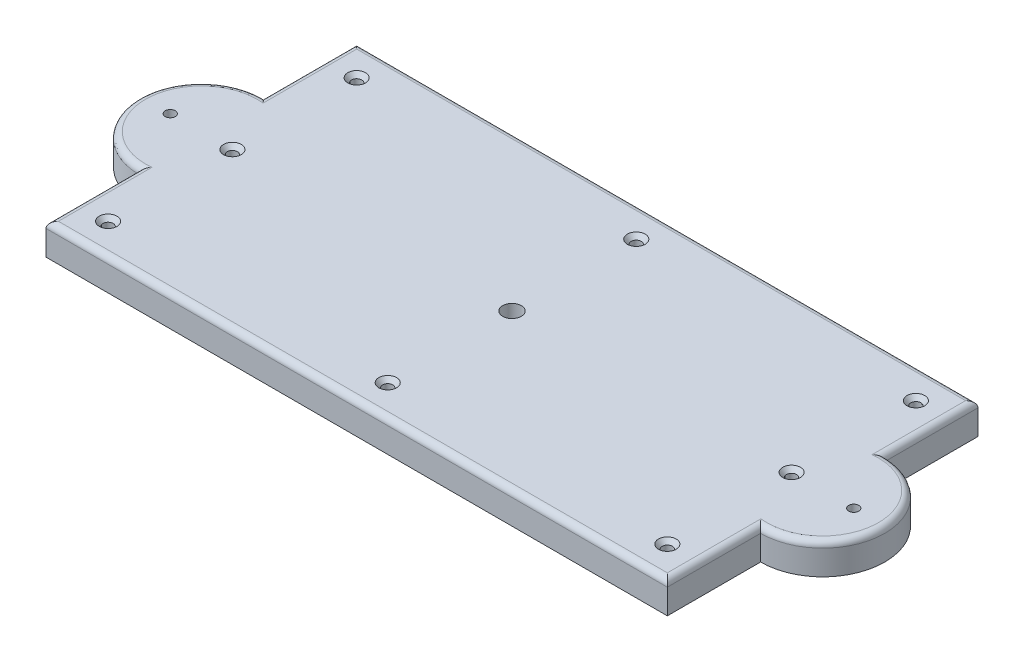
ISO-10303-21;
HEADER;
FILE_DESCRIPTION(('STEP AP214'),'2;1');
FILE_NAME('part.step','',(''),(''),'','','');
FILE_SCHEMA(('AUTOMOTIVE_DESIGN { 1 0 10303 214 1 1 1 1 }'));
ENDSEC;
DATA;
#1=APPLICATION_CONTEXT('core data for automotive mechanical design processes');
#2=APPLICATION_PROTOCOL_DEFINITION('international standard','automotive_design',2000,#1);
#3=PRODUCT_CONTEXT('',#1,'mechanical');
#4=PRODUCT('Part','Part','',(#3));
#5=PRODUCT_RELATED_PRODUCT_CATEGORY('part','',(#4));
#6=PRODUCT_DEFINITION_FORMATION('','',#4);
#7=PRODUCT_DEFINITION_CONTEXT('part definition',#1,'design');
#8=PRODUCT_DEFINITION('design','',#6,#7);
#9=PRODUCT_DEFINITION_SHAPE('','',#8);
#10=(LENGTH_UNIT() NAMED_UNIT(*) SI_UNIT(.MILLI.,.METRE.));
#11=(NAMED_UNIT(*) PLANE_ANGLE_UNIT() SI_UNIT($,.RADIAN.));
#12=(NAMED_UNIT(*) SI_UNIT($,.STERADIAN.) SOLID_ANGLE_UNIT());
#13=UNCERTAINTY_MEASURE_WITH_UNIT(LENGTH_MEASURE(1.E-05),#10,'distance_accuracy_value','');
#14=(GEOMETRIC_REPRESENTATION_CONTEXT(3) GLOBAL_UNCERTAINTY_ASSIGNED_CONTEXT((#13)) GLOBAL_UNIT_ASSIGNED_CONTEXT((#10,
#11,#12)) REPRESENTATION_CONTEXT('',''));
#15=CARTESIAN_POINT('',(0.,0.,0.));
#16=DIRECTION('',(0.,0.,1.));
#17=DIRECTION('',(1.,0.,0.));
#18=AXIS2_PLACEMENT_3D('',#15,#16,#17);
#19=CARTESIAN_POINT('',(0.,10.,-30.));
#20=DIRECTION('',(1.,0.,0.));
#21=DIRECTION('',(0.,0.,-1.));
#22=AXIS2_PLACEMENT_3D('',#19,#20,#21);
#23=PLANE('',#22);
#24=DIRECTION('',(0.,-1.,0.));
#25=VECTOR('',#24,1.);
#26=CARTESIAN_POINT('',(0.,10.,0.));
#27=LINE('',#26,#25);
#28=CARTESIAN_POINT('',(0.,8.,0.));
#29=VERTEX_POINT('',#28);
#30=CARTESIAN_POINT('',(0.,0.,0.));
#31=VERTEX_POINT('',#30);
#32=EDGE_CURVE('E135',#29,#31,#27,.T.);
#33=ORIENTED_EDGE('',*,*,#32,.F.);
#34=DIRECTION('',(0.,0.,1.));
#35=VECTOR('',#34,1.);
#36=CARTESIAN_POINT('',(0.,8.,-30.));
#37=LINE('',#36,#35);
#38=CARTESIAN_POINT('',(0.,8.,-30.));
#39=VERTEX_POINT('',#38);
#40=EDGE_CURVE('E55',#29,#39,#37,.F.);
#41=ORIENTED_EDGE('',*,*,#40,.T.);
#42=DIRECTION('',(0.,-1.,0.));
#43=VECTOR('',#42,1.);
#44=CARTESIAN_POINT('',(0.,10.,-30.));
#45=LINE('',#44,#43);
#46=CARTESIAN_POINT('',(0.,0.,-30.));
#47=VERTEX_POINT('',#46);
#48=EDGE_CURVE('E158',#39,#47,#45,.T.);
#49=ORIENTED_EDGE('',*,*,#48,.T.);
#50=DIRECTION('',(0.,0.,1.));
#51=VECTOR('',#50,1.);
#52=CARTESIAN_POINT('',(0.,0.,-30.));
#53=LINE('',#52,#51);
#54=EDGE_CURVE('E151',#47,#31,#53,.T.);
#55=ORIENTED_EDGE('',*,*,#54,.T.);
#56=EDGE_LOOP('',(#33,#41,#49,#55));
#57=FACE_BOUND('',#56,.T.);
#58=ADVANCED_FACE('F39',(#57),#23,.F.);
#59=CARTESIAN_POINT('',(0.,10.,0.));
#60=DIRECTION('',(0.,0.,-1.));
#61=DIRECTION('',(-1.,0.,0.));
#62=AXIS2_PLACEMENT_3D('',#59,#60,#61);
#63=PLANE('',#62);
#64=DIRECTION('',(0.,-1.,0.));
#65=VECTOR('',#64,1.);
#66=CARTESIAN_POINT('',(200.,10.,0.));
#67=LINE('',#66,#65);
#68=CARTESIAN_POINT('',(200.,8.,0.));
#69=VERTEX_POINT('',#68);
#70=CARTESIAN_POINT('',(200.,0.,0.));
#71=VERTEX_POINT('',#70);
#72=EDGE_CURVE('E145',#69,#71,#67,.T.);
#73=ORIENTED_EDGE('',*,*,#72,.F.);
#74=DIRECTION('',(1.,0.,0.));
#75=VECTOR('',#74,1.);
#76=CARTESIAN_POINT('',(0.,8.,0.));
#77=LINE('',#76,#75);
#78=EDGE_CURVE('E63',#69,#29,#77,.F.);
#79=ORIENTED_EDGE('',*,*,#78,.T.);
#80=ORIENTED_EDGE('',*,*,#32,.T.);
#81=DIRECTION('',(1.,0.,0.));
#82=VECTOR('',#81,1.);
#83=CARTESIAN_POINT('',(0.,0.,0.));
#84=LINE('',#83,#82);
#85=EDGE_CURVE('E138',#31,#71,#84,.T.);
#86=ORIENTED_EDGE('',*,*,#85,.T.);
#87=EDGE_LOOP('',(#73,#79,#80,#86));
#88=FACE_BOUND('',#87,.T.);
#89=ADVANCED_FACE('F137',(#88),#63,.F.);
#90=CARTESIAN_POINT('',(200.,10.,0.));
#91=DIRECTION('',(-1.,0.,0.));
#92=DIRECTION('',(0.,0.,1.));
#93=AXIS2_PLACEMENT_3D('',#90,#91,#92);
#94=PLANE('',#93);
#95=DIRECTION('',(0.,-1.,0.));
#96=VECTOR('',#95,1.);
#97=CARTESIAN_POINT('',(200.,10.,-30.));
#98=LINE('',#97,#96);
#99=CARTESIAN_POINT('',(200.,8.,-30.));
#100=VERTEX_POINT('',#99);
#101=CARTESIAN_POINT('',(200.,0.,-30.));
#102=VERTEX_POINT('',#101);
#103=EDGE_CURVE('E204',#100,#102,#98,.T.);
#104=ORIENTED_EDGE('',*,*,#103,.F.);
#105=DIRECTION('',(0.,0.,-1.));
#106=VECTOR('',#105,1.);
#107=CARTESIAN_POINT('',(200.,8.,0.));
#108=LINE('',#107,#106);
#109=EDGE_CURVE('E71',#100,#69,#108,.F.);
#110=ORIENTED_EDGE('',*,*,#109,.T.);
#111=ORIENTED_EDGE('',*,*,#72,.T.);
#112=DIRECTION('',(0.,0.,-1.));
#113=VECTOR('',#112,1.);
#114=CARTESIAN_POINT('',(200.,0.,0.));
#115=LINE('',#114,#113);
#116=EDGE_CURVE('E154',#71,#102,#115,.T.);
#117=ORIENTED_EDGE('',*,*,#116,.T.);
#118=EDGE_LOOP('',(#104,#110,#111,#117));
#119=FACE_BOUND('',#118,.T.);
#120=ADVANCED_FACE('F352',(#119),#94,.F.);
#121=CARTESIAN_POINT('',(200.,10.,-50.));
#122=DIRECTION('',(0.,-1.,0.));
#123=DIRECTION('',(0.,0.,-1.));
#124=AXIS2_PLACEMENT_3D('',#121,#122,#123);
#125=CYLINDRICAL_SURFACE('',#124,20.);
#126=DIRECTION('',(0.,-1.,0.));
#127=VECTOR('',#126,1.);
#128=CARTESIAN_POINT('',(200.,10.,-70.));
#129=LINE('',#128,#127);
#130=CARTESIAN_POINT('',(200.,8.,-70.));
#131=VERTEX_POINT('',#130);
#132=CARTESIAN_POINT('',(200.,0.,-70.));
#133=VERTEX_POINT('',#132);
#134=EDGE_CURVE('E201',#131,#133,#129,.T.);
#135=ORIENTED_EDGE('',*,*,#134,.F.);
#136=CARTESIAN_POINT('',(200.,8.,-50.));
#137=DIRECTION('',(0.,1.,0.));
#138=DIRECTION('',(0.,0.,1.));
#139=AXIS2_PLACEMENT_3D('',#136,#137,#138);
#140=CIRCLE('',#139,20.);
#141=EDGE_CURVE('E243',#131,#100,#140,.F.);
#142=ORIENTED_EDGE('',*,*,#141,.T.);
#143=ORIENTED_EDGE('',*,*,#103,.T.);
#144=CARTESIAN_POINT('',(200.,0.,-50.));
#145=DIRECTION('',(0.,1.,0.));
#146=DIRECTION('',(0.,0.,1.));
#147=AXIS2_PLACEMENT_3D('',#144,#145,#146);
#148=CIRCLE('',#147,20.);
#149=EDGE_CURVE('E171',#102,#133,#148,.T.);
#150=ORIENTED_EDGE('',*,*,#149,.T.);
#151=EDGE_LOOP('',(#135,#142,#143,#150));
#152=FACE_BOUND('',#151,.T.);
#153=ADVANCED_FACE('F350',(#152),#125,.T.);
#154=CARTESIAN_POINT('',(200.,10.,-70.));
#155=DIRECTION('',(-1.,0.,0.));
#156=DIRECTION('',(0.,0.,1.));
#157=AXIS2_PLACEMENT_3D('',#154,#155,#156);
#158=PLANE('',#157);
#159=DIRECTION('',(0.,-1.,0.));
#160=VECTOR('',#159,1.);
#161=CARTESIAN_POINT('',(200.,10.,-100.));
#162=LINE('',#161,#160);
#163=CARTESIAN_POINT('',(200.,8.,-100.));
#164=VERTEX_POINT('',#163);
#165=CARTESIAN_POINT('',(200.,0.,-100.));
#166=VERTEX_POINT('',#165);
#167=EDGE_CURVE('E198',#164,#166,#162,.T.);
#168=ORIENTED_EDGE('',*,*,#167,.F.);
#169=DIRECTION('',(0.,0.,-1.));
#170=VECTOR('',#169,1.);
#171=CARTESIAN_POINT('',(200.,8.,-70.));
#172=LINE('',#171,#170);
#173=EDGE_CURVE('E240',#164,#131,#172,.F.);
#174=ORIENTED_EDGE('',*,*,#173,.T.);
#175=ORIENTED_EDGE('',*,*,#134,.T.);
#176=DIRECTION('',(0.,0.,-1.));
#177=VECTOR('',#176,1.);
#178=CARTESIAN_POINT('',(200.,0.,-70.));
#179=LINE('',#178,#177);
#180=EDGE_CURVE('E175',#133,#166,#179,.T.);
#181=ORIENTED_EDGE('',*,*,#180,.T.);
#182=EDGE_LOOP('',(#168,#174,#175,#181));
#183=FACE_BOUND('',#182,.T.);
#184=ADVANCED_FACE('F346',(#183),#158,.F.);
#185=CARTESIAN_POINT('',(200.,10.,-100.));
#186=DIRECTION('',(0.,0.,1.));
#187=DIRECTION('',(1.,0.,0.));
#188=AXIS2_PLACEMENT_3D('',#185,#186,#187);
#189=PLANE('',#188);
#190=DIRECTION('',(0.,-1.,0.));
#191=VECTOR('',#190,1.);
#192=CARTESIAN_POINT('',(0.,10.,-100.));
#193=LINE('',#192,#191);
#194=CARTESIAN_POINT('',(0.,8.,-100.));
#195=VERTEX_POINT('',#194);
#196=CARTESIAN_POINT('',(0.,0.,-100.));
#197=VERTEX_POINT('',#196);
#198=EDGE_CURVE('E195',#195,#197,#193,.T.);
#199=ORIENTED_EDGE('',*,*,#198,.F.);
#200=DIRECTION('',(-1.,0.,0.));
#201=VECTOR('',#200,1.);
#202=CARTESIAN_POINT('',(200.,8.,-100.));
#203=LINE('',#202,#201);
#204=EDGE_CURVE('E11',#195,#164,#203,.F.);
#205=ORIENTED_EDGE('',*,*,#204,.T.);
#206=ORIENTED_EDGE('',*,*,#167,.T.);
#207=DIRECTION('',(-1.,0.,0.));
#208=VECTOR('',#207,1.);
#209=CARTESIAN_POINT('',(200.,0.,-100.));
#210=LINE('',#209,#208);
#211=EDGE_CURVE('E179',#166,#197,#210,.T.);
#212=ORIENTED_EDGE('',*,*,#211,.T.);
#213=EDGE_LOOP('',(#199,#205,#206,#212));
#214=FACE_BOUND('',#213,.T.);
#215=ADVANCED_FACE('F341',(#214),#189,.F.);
#216=CARTESIAN_POINT('',(0.,10.,-100.));
#217=DIRECTION('',(1.,0.,0.));
#218=DIRECTION('',(0.,0.,-1.));
#219=AXIS2_PLACEMENT_3D('',#216,#217,#218);
#220=PLANE('',#219);
#221=DIRECTION('',(0.,-1.,0.));
#222=VECTOR('',#221,1.);
#223=CARTESIAN_POINT('',(0.,10.,-70.));
#224=LINE('',#223,#222);
#225=CARTESIAN_POINT('',(0.,8.,-70.));
#226=VERTEX_POINT('',#225);
#227=CARTESIAN_POINT('',(0.,0.,-70.));
#228=VERTEX_POINT('',#227);
#229=EDGE_CURVE('E192',#226,#228,#224,.T.);
#230=ORIENTED_EDGE('',*,*,#229,.F.);
#231=DIRECTION('',(0.,0.,1.));
#232=VECTOR('',#231,1.);
#233=CARTESIAN_POINT('',(0.,8.,-100.));
#234=LINE('',#233,#232);
#235=EDGE_CURVE('E237',#226,#195,#234,.F.);
#236=ORIENTED_EDGE('',*,*,#235,.T.);
#237=ORIENTED_EDGE('',*,*,#198,.T.);
#238=DIRECTION('',(0.,0.,1.));
#239=VECTOR('',#238,1.);
#240=CARTESIAN_POINT('',(0.,0.,-100.));
#241=LINE('',#240,#239);
#242=EDGE_CURVE('E183',#197,#228,#241,.T.);
#243=ORIENTED_EDGE('',*,*,#242,.T.);
#244=EDGE_LOOP('',(#230,#236,#237,#243));
#245=FACE_BOUND('',#244,.T.);
#246=ADVANCED_FACE('F336',(#245),#220,.F.);
#247=CARTESIAN_POINT('',(0.,10.,-50.));
#248=DIRECTION('',(0.,-1.,0.));
#249=DIRECTION('',(0.,0.,-1.));
#250=AXIS2_PLACEMENT_3D('',#247,#248,#249);
#251=CYLINDRICAL_SURFACE('',#250,20.);
#252=ORIENTED_EDGE('',*,*,#48,.F.);
#253=CARTESIAN_POINT('',(0.,8.,-50.));
#254=DIRECTION('',(0.,1.,0.));
#255=DIRECTION('',(0.,0.,1.));
#256=AXIS2_PLACEMENT_3D('',#253,#254,#255);
#257=CIRCLE('',#256,20.);
#258=EDGE_CURVE('E233',#39,#226,#257,.F.);
#259=ORIENTED_EDGE('',*,*,#258,.T.);
#260=ORIENTED_EDGE('',*,*,#229,.T.);
#261=CARTESIAN_POINT('',(0.,0.,-50.));
#262=DIRECTION('',(0.,1.,0.));
#263=DIRECTION('',(0.,0.,1.));
#264=AXIS2_PLACEMENT_3D('',#261,#262,#263);
#265=CIRCLE('',#264,20.);
#266=EDGE_CURVE('E187',#228,#47,#265,.T.);
#267=ORIENTED_EDGE('',*,*,#266,.T.);
#268=EDGE_LOOP('',(#252,#259,#260,#267));
#269=FACE_BOUND('',#268,.T.);
#270=ADVANCED_FACE('F335',(#269),#251,.T.);
#271=CARTESIAN_POINT('',(200.,10.,-50.));
#272=DIRECTION('',(0.,1.,0.));
#273=DIRECTION('',(0.,0.,1.));
#274=AXIS2_PLACEMENT_3D('',#271,#272,#273);
#275=PLANE('',#274);
#276=CARTESIAN_POINT('',(100.,10.,-50.));
#277=DIRECTION('',(0.,1.,0.));
#278=DIRECTION('',(0.,0.,1.));
#279=AXIS2_PLACEMENT_3D('',#276,#277,#278);
#280=CIRCLE('',#279,3.00000000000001);
#281=CARTESIAN_POINT('',(100.,10.,-47.));
#282=VERTEX_POINT('',#281);
#283=EDGE_CURVE('E380',#282,#282,#280,.T.);
#284=ORIENTED_EDGE('',*,*,#283,.F.);
#285=EDGE_LOOP('',(#284));
#286=FACE_BOUND('',#285,.T.);
#287=DIRECTION('',(0.,0.,-1.));
#288=VECTOR('',#287,1.);
#289=CARTESIAN_POINT('',(198.,10.,-30.));
#290=LINE('',#289,#288);
#291=CARTESIAN_POINT('',(198.,10.,-2.));
#292=VERTEX_POINT('',#291);
#293=CARTESIAN_POINT('',(198.,10.,-32.1114561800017));
#294=VERTEX_POINT('',#293);
#295=EDGE_CURVE('E227',#292,#294,#290,.T.);
#296=ORIENTED_EDGE('',*,*,#295,.T.);
#297=CARTESIAN_POINT('',(200.,10.,-50.));
#298=DIRECTION('',(0.,1.,0.));
#299=DIRECTION('',(0.,0.,1.));
#300=AXIS2_PLACEMENT_3D('',#297,#298,#299);
#301=CIRCLE('',#300,18.);
#302=CARTESIAN_POINT('',(198.,10.,-67.8885438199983));
#303=VERTEX_POINT('',#302);
#304=EDGE_CURVE('E230',#294,#303,#301,.T.);
#305=ORIENTED_EDGE('',*,*,#304,.T.);
#306=DIRECTION('',(0.,0.,-1.));
#307=VECTOR('',#306,1.);
#308=CARTESIAN_POINT('',(198.,10.,-100.));
#309=LINE('',#308,#307);
#310=CARTESIAN_POINT('',(198.,10.,-98.));
#311=VERTEX_POINT('',#310);
#312=EDGE_CURVE('E211',#303,#311,#309,.T.);
#313=ORIENTED_EDGE('',*,*,#312,.T.);
#314=DIRECTION('',(-1.,0.,0.));
#315=VECTOR('',#314,1.);
#316=CARTESIAN_POINT('',(0.,10.,-98.));
#317=LINE('',#316,#315);
#318=CARTESIAN_POINT('',(2.,10.,-98.));
#319=VERTEX_POINT('',#318);
#320=EDGE_CURVE('E144',#311,#319,#317,.T.);
#321=ORIENTED_EDGE('',*,*,#320,.T.);
#322=DIRECTION('',(0.,0.,1.));
#323=VECTOR('',#322,1.);
#324=CARTESIAN_POINT('',(2.,10.,-70.));
#325=LINE('',#324,#323);
#326=CARTESIAN_POINT('',(2.,10.,-67.8885438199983));
#327=VERTEX_POINT('',#326);
#328=EDGE_CURVE('E214',#319,#327,#325,.T.);
#329=ORIENTED_EDGE('',*,*,#328,.T.);
#330=CARTESIAN_POINT('',(0.,10.,-50.));
#331=DIRECTION('',(0.,1.,0.));
#332=DIRECTION('',(0.,0.,1.));
#333=AXIS2_PLACEMENT_3D('',#330,#331,#332);
#334=CIRCLE('',#333,18.);
#335=CARTESIAN_POINT('',(2.,10.,-32.1114561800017));
#336=VERTEX_POINT('',#335);
#337=EDGE_CURVE('E217',#327,#336,#334,.T.);
#338=ORIENTED_EDGE('',*,*,#337,.T.);
#339=DIRECTION('',(0.,0.,1.));
#340=VECTOR('',#339,1.);
#341=CARTESIAN_POINT('',(2.,10.,0.));
#342=LINE('',#341,#340);
#343=CARTESIAN_POINT('',(2.,10.,-2.));
#344=VERTEX_POINT('',#343);
#345=EDGE_CURVE('E221',#336,#344,#342,.T.);
#346=ORIENTED_EDGE('',*,*,#345,.T.);
#347=DIRECTION('',(1.,0.,0.));
#348=VECTOR('',#347,1.);
#349=CARTESIAN_POINT('',(200.,10.,-2.));
#350=LINE('',#349,#348);
#351=EDGE_CURVE('E224',#344,#292,#350,.T.);
#352=ORIENTED_EDGE('',*,*,#351,.T.);
#353=EDGE_LOOP('',(#296,#305,#313,#321,#329,#338,#346,#352));
#354=FACE_BOUND('',#353,.T.);
#355=CARTESIAN_POINT('',(210.,10.,-50.));
#356=DIRECTION('',(0.,-1.,0.));
#357=DIRECTION('',(0.,0.,-1.));
#358=AXIS2_PLACEMENT_3D('',#355,#356,#357);
#359=CIRCLE('',#358,1.63194999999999);
#360=CARTESIAN_POINT('',(210.,10.,-51.63195));
#361=VERTEX_POINT('',#360);
#362=EDGE_CURVE('E377',#361,#361,#359,.T.);
#363=ORIENTED_EDGE('',*,*,#362,.T.);
#364=EDGE_LOOP('',(#363));
#365=FACE_BOUND('',#364,.T.);
#366=CARTESIAN_POINT('',(-10.,10.,-50.));
#367=DIRECTION('',(0.,-1.,0.));
#368=DIRECTION('',(0.,0.,-1.));
#369=AXIS2_PLACEMENT_3D('',#366,#367,#368);
#370=CIRCLE('',#369,1.63195);
#371=CARTESIAN_POINT('',(-10.,10.,-51.63195));
#372=VERTEX_POINT('',#371);
#373=EDGE_CURVE('E394',#372,#372,#370,.T.);
#374=ORIENTED_EDGE('',*,*,#373,.T.);
#375=EDGE_LOOP('',(#374));
#376=FACE_BOUND('',#375,.T.);
#377=CARTESIAN_POINT('',(10.,10.,-90.));
#378=DIRECTION('',(0.,1.,0.));
#379=DIRECTION('',(0.,0.,1.));
#380=AXIS2_PLACEMENT_3D('',#377,#378,#379);
#381=CIRCLE('',#380,2.8575);
#382=CARTESIAN_POINT('',(10.,10.,-87.1425));
#383=VERTEX_POINT('',#382);
#384=EDGE_CURVE('E398',#383,#383,#381,.T.);
#385=ORIENTED_EDGE('',*,*,#384,.F.);
#386=EDGE_LOOP('',(#385));
#387=FACE_BOUND('',#386,.T.);
#388=CARTESIAN_POINT('',(10.,10.,-50.));
#389=DIRECTION('',(0.,1.,0.));
#390=DIRECTION('',(0.,0.,1.));
#391=AXIS2_PLACEMENT_3D('',#388,#389,#390);
#392=CIRCLE('',#391,2.8575);
#393=CARTESIAN_POINT('',(10.,10.,-47.1425));
#394=VERTEX_POINT('',#393);
#395=EDGE_CURVE('E410',#394,#394,#392,.T.);
#396=ORIENTED_EDGE('',*,*,#395,.F.);
#397=EDGE_LOOP('',(#396));
#398=FACE_BOUND('',#397,.T.);
#399=CARTESIAN_POINT('',(10.,10.,-10.));
#400=DIRECTION('',(0.,1.,0.));
#401=DIRECTION('',(0.,0.,1.));
#402=AXIS2_PLACEMENT_3D('',#399,#400,#401);
#403=CIRCLE('',#402,2.8575);
#404=CARTESIAN_POINT('',(10.,10.,-7.1425));
#405=VERTEX_POINT('',#404);
#406=EDGE_CURVE('E422',#405,#405,#403,.T.);
#407=ORIENTED_EDGE('',*,*,#406,.F.);
#408=EDGE_LOOP('',(#407));
#409=FACE_BOUND('',#408,.T.);
#410=CARTESIAN_POINT('',(100.,10.,-90.));
#411=DIRECTION('',(0.,1.,0.));
#412=DIRECTION('',(0.,0.,1.));
#413=AXIS2_PLACEMENT_3D('',#410,#411,#412);
#414=CIRCLE('',#413,2.8575);
#415=CARTESIAN_POINT('',(100.,10.,-87.1425));
#416=VERTEX_POINT('',#415);
#417=EDGE_CURVE('E434',#416,#416,#414,.T.);
#418=ORIENTED_EDGE('',*,*,#417,.F.);
#419=EDGE_LOOP('',(#418));
#420=FACE_BOUND('',#419,.T.);
#421=CARTESIAN_POINT('',(190.,10.,-90.));
#422=DIRECTION('',(0.,1.,0.));
#423=DIRECTION('',(0.,0.,1.));
#424=AXIS2_PLACEMENT_3D('',#421,#422,#423);
#425=CIRCLE('',#424,2.85750000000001);
#426=CARTESIAN_POINT('',(190.,10.,-87.1425));
#427=VERTEX_POINT('',#426);
#428=EDGE_CURVE('E446',#427,#427,#425,.T.);
#429=ORIENTED_EDGE('',*,*,#428,.F.);
#430=EDGE_LOOP('',(#429));
#431=FACE_BOUND('',#430,.T.);
#432=CARTESIAN_POINT('',(190.,10.,-50.));
#433=DIRECTION('',(0.,1.,0.));
#434=DIRECTION('',(0.,0.,1.));
#435=AXIS2_PLACEMENT_3D('',#432,#433,#434);
#436=CIRCLE('',#435,2.85750000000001);
#437=CARTESIAN_POINT('',(190.,10.,-47.1425));
#438=VERTEX_POINT('',#437);
#439=EDGE_CURVE('E458',#438,#438,#436,.T.);
#440=ORIENTED_EDGE('',*,*,#439,.F.);
#441=EDGE_LOOP('',(#440));
#442=FACE_BOUND('',#441,.T.);
#443=CARTESIAN_POINT('',(190.,10.,-10.));
#444=DIRECTION('',(0.,1.,0.));
#445=DIRECTION('',(0.,0.,1.));
#446=AXIS2_PLACEMENT_3D('',#443,#444,#445);
#447=CIRCLE('',#446,2.85750000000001);
#448=CARTESIAN_POINT('',(190.,10.,-7.14249999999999));
#449=VERTEX_POINT('',#448);
#450=EDGE_CURVE('E470',#449,#449,#447,.T.);
#451=ORIENTED_EDGE('',*,*,#450,.F.);
#452=EDGE_LOOP('',(#451));
#453=FACE_BOUND('',#452,.T.);
#454=CARTESIAN_POINT('',(100.,10.,-10.));
#455=DIRECTION('',(0.,1.,0.));
#456=DIRECTION('',(0.,0.,1.));
#457=AXIS2_PLACEMENT_3D('',#454,#455,#456);
#458=CIRCLE('',#457,2.8575);
#459=CARTESIAN_POINT('',(100.,10.,-7.1425));
#460=VERTEX_POINT('',#459);
#461=EDGE_CURVE('E482',#460,#460,#458,.T.);
#462=ORIENTED_EDGE('',*,*,#461,.F.);
#463=EDGE_LOOP('',(#462));
#464=FACE_BOUND('',#463,.T.);
#465=ADVANCED_FACE('F358',(#286,#354,#365,#376,#387,#398,#409,#420,#431,#442,#453,#464),#275,.T.);
#466=CARTESIAN_POINT('',(200.,0.,-50.));
#467=DIRECTION('',(0.,1.,0.));
#468=DIRECTION('',(0.,0.,1.));
#469=AXIS2_PLACEMENT_3D('',#466,#467,#468);
#470=PLANE('',#469);
#471=CARTESIAN_POINT('',(100.,0.,-50.));
#472=DIRECTION('',(0.,1.,0.));
#473=DIRECTION('',(0.,0.,1.));
#474=AXIS2_PLACEMENT_3D('',#471,#472,#473);
#475=CIRCLE('',#474,3.00000000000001);
#476=CARTESIAN_POINT('',(100.,0.,-47.));
#477=VERTEX_POINT('',#476);
#478=EDGE_CURVE('E262',#477,#477,#475,.T.);
#479=ORIENTED_EDGE('',*,*,#478,.T.);
#480=EDGE_LOOP('',(#479));
#481=FACE_BOUND('',#480,.T.);
#482=CARTESIAN_POINT('',(210.,0.,-50.));
#483=DIRECTION('',(0.,-1.,0.));
#484=DIRECTION('',(0.,0.,-1.));
#485=AXIS2_PLACEMENT_3D('',#482,#483,#484);
#486=CIRCLE('',#485,2.85750000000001);
#487=CARTESIAN_POINT('',(210.,0.,-52.8575));
#488=VERTEX_POINT('',#487);
#489=EDGE_CURVE('E368',#488,#488,#486,.T.);
#490=ORIENTED_EDGE('',*,*,#489,.F.);
#491=EDGE_LOOP('',(#490));
#492=FACE_BOUND('',#491,.T.);
#493=CARTESIAN_POINT('',(-10.,0.,-50.));
#494=DIRECTION('',(0.,-1.,0.));
#495=DIRECTION('',(0.,0.,-1.));
#496=AXIS2_PLACEMENT_3D('',#493,#494,#495);
#497=CIRCLE('',#496,2.8575);
#498=CARTESIAN_POINT('',(-10.,0.,-52.8575));
#499=VERTEX_POINT('',#498);
#500=EDGE_CURVE('E386',#499,#499,#497,.T.);
#501=ORIENTED_EDGE('',*,*,#500,.F.);
#502=EDGE_LOOP('',(#501));
#503=FACE_BOUND('',#502,.T.);
#504=CARTESIAN_POINT('',(10.,0.,-90.));
#505=DIRECTION('',(0.,1.,0.));
#506=DIRECTION('',(0.,0.,1.));
#507=AXIS2_PLACEMENT_3D('',#504,#505,#506);
#508=CIRCLE('',#507,1.63195);
#509=CARTESIAN_POINT('',(10.,0.,-88.36805));
#510=VERTEX_POINT('',#509);
#511=EDGE_CURVE('E406',#510,#510,#508,.T.);
#512=ORIENTED_EDGE('',*,*,#511,.T.);
#513=EDGE_LOOP('',(#512));
#514=FACE_BOUND('',#513,.T.);
#515=CARTESIAN_POINT('',(10.,0.,-50.));
#516=DIRECTION('',(0.,1.,0.));
#517=DIRECTION('',(0.,0.,1.));
#518=AXIS2_PLACEMENT_3D('',#515,#516,#517);
#519=CIRCLE('',#518,1.63195);
#520=CARTESIAN_POINT('',(10.,0.,-48.36805));
#521=VERTEX_POINT('',#520);
#522=EDGE_CURVE('E418',#521,#521,#519,.T.);
#523=ORIENTED_EDGE('',*,*,#522,.T.);
#524=EDGE_LOOP('',(#523));
#525=FACE_BOUND('',#524,.T.);
#526=CARTESIAN_POINT('',(10.,0.,-10.));
#527=DIRECTION('',(0.,1.,0.));
#528=DIRECTION('',(0.,0.,1.));
#529=AXIS2_PLACEMENT_3D('',#526,#527,#528);
#530=CIRCLE('',#529,1.63195);
#531=CARTESIAN_POINT('',(10.,0.,-8.36805));
#532=VERTEX_POINT('',#531);
#533=EDGE_CURVE('E430',#532,#532,#530,.T.);
#534=ORIENTED_EDGE('',*,*,#533,.T.);
#535=EDGE_LOOP('',(#534));
#536=FACE_BOUND('',#535,.T.);
#537=CARTESIAN_POINT('',(100.,0.,-90.));
#538=DIRECTION('',(0.,1.,0.));
#539=DIRECTION('',(0.,0.,1.));
#540=AXIS2_PLACEMENT_3D('',#537,#538,#539);
#541=CIRCLE('',#540,1.63194999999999);
#542=CARTESIAN_POINT('',(100.,0.,-88.36805));
#543=VERTEX_POINT('',#542);
#544=EDGE_CURVE('E442',#543,#543,#541,.T.);
#545=ORIENTED_EDGE('',*,*,#544,.T.);
#546=EDGE_LOOP('',(#545));
#547=FACE_BOUND('',#546,.T.);
#548=CARTESIAN_POINT('',(190.,0.,-90.));
#549=DIRECTION('',(0.,1.,0.));
#550=DIRECTION('',(0.,0.,1.));
#551=AXIS2_PLACEMENT_3D('',#548,#549,#550);
#552=CIRCLE('',#551,1.63194999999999);
#553=CARTESIAN_POINT('',(190.,0.,-88.36805));
#554=VERTEX_POINT('',#553);
#555=EDGE_CURVE('E454',#554,#554,#552,.T.);
#556=ORIENTED_EDGE('',*,*,#555,.T.);
#557=EDGE_LOOP('',(#556));
#558=FACE_BOUND('',#557,.T.);
#559=CARTESIAN_POINT('',(190.,0.,-50.));
#560=DIRECTION('',(0.,1.,0.));
#561=DIRECTION('',(0.,0.,1.));
#562=AXIS2_PLACEMENT_3D('',#559,#560,#561);
#563=CIRCLE('',#562,1.63194999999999);
#564=CARTESIAN_POINT('',(190.,0.,-48.36805));
#565=VERTEX_POINT('',#564);
#566=EDGE_CURVE('E466',#565,#565,#563,.T.);
#567=ORIENTED_EDGE('',*,*,#566,.T.);
#568=EDGE_LOOP('',(#567));
#569=FACE_BOUND('',#568,.T.);
#570=CARTESIAN_POINT('',(190.,0.,-10.));
#571=DIRECTION('',(0.,1.,0.));
#572=DIRECTION('',(0.,0.,1.));
#573=AXIS2_PLACEMENT_3D('',#570,#571,#572);
#574=CIRCLE('',#573,1.63194999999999);
#575=CARTESIAN_POINT('',(190.,0.,-8.36805000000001));
#576=VERTEX_POINT('',#575);
#577=EDGE_CURVE('E478',#576,#576,#574,.T.);
#578=ORIENTED_EDGE('',*,*,#577,.T.);
#579=EDGE_LOOP('',(#578));
#580=FACE_BOUND('',#579,.T.);
#581=CARTESIAN_POINT('',(100.,0.,-10.));
#582=DIRECTION('',(0.,1.,0.));
#583=DIRECTION('',(0.,0.,1.));
#584=AXIS2_PLACEMENT_3D('',#581,#582,#583);
#585=CIRCLE('',#584,1.63194999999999);
#586=CARTESIAN_POINT('',(100.,0.,-8.36805000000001));
#587=VERTEX_POINT('',#586);
#588=EDGE_CURVE('E161',#587,#587,#585,.T.);
#589=ORIENTED_EDGE('',*,*,#588,.T.);
#590=EDGE_LOOP('',(#589));
#591=FACE_BOUND('',#590,.T.);
#592=ORIENTED_EDGE('',*,*,#54,.F.);
#593=ORIENTED_EDGE('',*,*,#266,.F.);
#594=ORIENTED_EDGE('',*,*,#242,.F.);
#595=ORIENTED_EDGE('',*,*,#211,.F.);
#596=ORIENTED_EDGE('',*,*,#180,.F.);
#597=ORIENTED_EDGE('',*,*,#149,.F.);
#598=ORIENTED_EDGE('',*,*,#116,.F.);
#599=ORIENTED_EDGE('',*,*,#85,.F.);
#600=EDGE_LOOP('',(#592,#593,#594,#595,#596,#597,#598,#599));
#601=FACE_BOUND('',#600,.T.);
#602=ADVANCED_FACE('F149',(#481,#492,#503,#514,#525,#536,#547,#558,#569,#580,#591,#601),#470,.F.);
#603=CARTESIAN_POINT('',(100.,10.,-10.));
#604=DIRECTION('',(0.,1.,0.));
#605=DIRECTION('',(0.,0.,1.));
#606=AXIS2_PLACEMENT_3D('',#603,#604,#605);
#607=CYLINDRICAL_SURFACE('',#606,1.63194999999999);
#608=ORIENTED_EDGE('',*,*,#588,.F.);
#609=EDGE_LOOP('',(#608));
#610=FACE_BOUND('',#609,.T.);
#611=CARTESIAN_POINT('',(100.,8.59016599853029,-10.));
#612=DIRECTION('',(0.,1.,0.));
#613=DIRECTION('',(0.,0.,1.));
#614=AXIS2_PLACEMENT_3D('',#611,#612,#613);
#615=CIRCLE('',#614,1.63194999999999);
#616=CARTESIAN_POINT('',(100.,8.59016599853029,-8.36805000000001));
#617=VERTEX_POINT('',#616);
#618=EDGE_CURVE('E165',#617,#617,#615,.T.);
#619=ORIENTED_EDGE('',*,*,#618,.T.);
#620=EDGE_LOOP('',(#619));
#621=FACE_BOUND('',#620,.T.);
#622=ADVANCED_FACE('F489',(#610,#621),#607,.F.);
#623=CARTESIAN_POINT('',(100.,10.,-10.));
#624=DIRECTION('',(0.,1.,0.));
#625=DIRECTION('',(0.,0.,1.));
#626=AXIS2_PLACEMENT_3D('',#623,#624,#625);
#627=CONICAL_SURFACE('',#626,2.8575,0.715584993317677);
#628=ORIENTED_EDGE('',*,*,#618,.F.);
#629=EDGE_LOOP('',(#628));
#630=FACE_BOUND('',#629,.T.);
#631=ORIENTED_EDGE('',*,*,#461,.T.);
#632=EDGE_LOOP('',(#631));
#633=FACE_BOUND('',#632,.T.);
#634=ADVANCED_FACE('F491',(#630,#633),#627,.F.);
#635=CARTESIAN_POINT('',(190.,10.,-10.));
#636=DIRECTION('',(0.,1.,0.));
#637=DIRECTION('',(0.,0.,1.));
#638=AXIS2_PLACEMENT_3D('',#635,#636,#637);
#639=CYLINDRICAL_SURFACE('',#638,1.63194999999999);
#640=ORIENTED_EDGE('',*,*,#577,.F.);
#641=EDGE_LOOP('',(#640));
#642=FACE_BOUND('',#641,.T.);
#643=CARTESIAN_POINT('',(190.,8.59016599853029,-10.));
#644=DIRECTION('',(0.,1.,0.));
#645=DIRECTION('',(0.,0.,1.));
#646=AXIS2_PLACEMENT_3D('',#643,#644,#645);
#647=CIRCLE('',#646,1.63194999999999);
#648=CARTESIAN_POINT('',(190.,8.59016599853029,-8.36805000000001));
#649=VERTEX_POINT('',#648);
#650=EDGE_CURVE('E474',#649,#649,#647,.T.);
#651=ORIENTED_EDGE('',*,*,#650,.T.);
#652=EDGE_LOOP('',(#651));
#653=FACE_BOUND('',#652,.T.);
#654=ADVANCED_FACE('F494',(#642,#653),#639,.F.);
#655=CARTESIAN_POINT('',(190.,10.,-10.));
#656=DIRECTION('',(0.,1.,0.));
#657=DIRECTION('',(0.,0.,1.));
#658=AXIS2_PLACEMENT_3D('',#655,#656,#657);
#659=CONICAL_SURFACE('',#658,2.85750000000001,0.715584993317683);
#660=ORIENTED_EDGE('',*,*,#650,.F.);
#661=EDGE_LOOP('',(#660));
#662=FACE_BOUND('',#661,.T.);
#663=ORIENTED_EDGE('',*,*,#450,.T.);
#664=EDGE_LOOP('',(#663));
#665=FACE_BOUND('',#664,.T.);
#666=ADVANCED_FACE('F675',(#662,#665),#659,.F.);
#667=CARTESIAN_POINT('',(190.,10.,-50.));
#668=DIRECTION('',(0.,1.,0.));
#669=DIRECTION('',(0.,0.,1.));
#670=AXIS2_PLACEMENT_3D('',#667,#668,#669);
#671=CYLINDRICAL_SURFACE('',#670,1.63194999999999);
#672=ORIENTED_EDGE('',*,*,#566,.F.);
#673=EDGE_LOOP('',(#672));
#674=FACE_BOUND('',#673,.T.);
#675=CARTESIAN_POINT('',(190.,8.59016599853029,-50.));
#676=DIRECTION('',(0.,1.,0.));
#677=DIRECTION('',(0.,0.,1.));
#678=AXIS2_PLACEMENT_3D('',#675,#676,#677);
#679=CIRCLE('',#678,1.63194999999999);
#680=CARTESIAN_POINT('',(190.,8.59016599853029,-48.36805));
#681=VERTEX_POINT('',#680);
#682=EDGE_CURVE('E462',#681,#681,#679,.T.);
#683=ORIENTED_EDGE('',*,*,#682,.T.);
#684=EDGE_LOOP('',(#683));
#685=FACE_BOUND('',#684,.T.);
#686=ADVANCED_FACE('F671',(#674,#685),#671,.F.);
#687=CARTESIAN_POINT('',(190.,10.,-50.));
#688=DIRECTION('',(0.,1.,0.));
#689=DIRECTION('',(0.,0.,1.));
#690=AXIS2_PLACEMENT_3D('',#687,#688,#689);
#691=CONICAL_SURFACE('',#690,2.85750000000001,0.715584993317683);
#692=ORIENTED_EDGE('',*,*,#682,.F.);
#693=EDGE_LOOP('',(#692));
#694=FACE_BOUND('',#693,.T.);
#695=ORIENTED_EDGE('',*,*,#439,.T.);
#696=EDGE_LOOP('',(#695));
#697=FACE_BOUND('',#696,.T.);
#698=ADVANCED_FACE('F667',(#694,#697),#691,.F.);
#699=CARTESIAN_POINT('',(190.,10.,-90.));
#700=DIRECTION('',(0.,1.,0.));
#701=DIRECTION('',(0.,0.,1.));
#702=AXIS2_PLACEMENT_3D('',#699,#700,#701);
#703=CYLINDRICAL_SURFACE('',#702,1.63194999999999);
#704=ORIENTED_EDGE('',*,*,#555,.F.);
#705=EDGE_LOOP('',(#704));
#706=FACE_BOUND('',#705,.T.);
#707=CARTESIAN_POINT('',(190.,8.59016599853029,-90.));
#708=DIRECTION('',(0.,1.,0.));
#709=DIRECTION('',(0.,0.,1.));
#710=AXIS2_PLACEMENT_3D('',#707,#708,#709);
#711=CIRCLE('',#710,1.63194999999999);
#712=CARTESIAN_POINT('',(190.,8.59016599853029,-88.36805));
#713=VERTEX_POINT('',#712);
#714=EDGE_CURVE('E450',#713,#713,#711,.T.);
#715=ORIENTED_EDGE('',*,*,#714,.T.);
#716=EDGE_LOOP('',(#715));
#717=FACE_BOUND('',#716,.T.);
#718=ADVANCED_FACE('F663',(#706,#717),#703,.F.);
#719=CARTESIAN_POINT('',(190.,10.,-90.));
#720=DIRECTION('',(0.,1.,0.));
#721=DIRECTION('',(0.,0.,1.));
#722=AXIS2_PLACEMENT_3D('',#719,#720,#721);
#723=CONICAL_SURFACE('',#722,2.85750000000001,0.715584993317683);
#724=ORIENTED_EDGE('',*,*,#714,.F.);
#725=EDGE_LOOP('',(#724));
#726=FACE_BOUND('',#725,.T.);
#727=ORIENTED_EDGE('',*,*,#428,.T.);
#728=EDGE_LOOP('',(#727));
#729=FACE_BOUND('',#728,.T.);
#730=ADVANCED_FACE('F659',(#726,#729),#723,.F.);
#731=CARTESIAN_POINT('',(100.,10.,-90.));
#732=DIRECTION('',(0.,1.,0.));
#733=DIRECTION('',(0.,0.,1.));
#734=AXIS2_PLACEMENT_3D('',#731,#732,#733);
#735=CYLINDRICAL_SURFACE('',#734,1.63194999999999);
#736=ORIENTED_EDGE('',*,*,#544,.F.);
#737=EDGE_LOOP('',(#736));
#738=FACE_BOUND('',#737,.T.);
#739=CARTESIAN_POINT('',(100.,8.59016599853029,-90.));
#740=DIRECTION('',(0.,1.,0.));
#741=DIRECTION('',(0.,0.,1.));
#742=AXIS2_PLACEMENT_3D('',#739,#740,#741);
#743=CIRCLE('',#742,1.63194999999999);
#744=CARTESIAN_POINT('',(100.,8.59016599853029,-88.36805));
#745=VERTEX_POINT('',#744);
#746=EDGE_CURVE('E438',#745,#745,#743,.T.);
#747=ORIENTED_EDGE('',*,*,#746,.T.);
#748=EDGE_LOOP('',(#747));
#749=FACE_BOUND('',#748,.T.);
#750=ADVANCED_FACE('F655',(#738,#749),#735,.F.);
#751=CARTESIAN_POINT('',(100.,10.,-90.));
#752=DIRECTION('',(0.,1.,0.));
#753=DIRECTION('',(0.,0.,1.));
#754=AXIS2_PLACEMENT_3D('',#751,#752,#753);
#755=CONICAL_SURFACE('',#754,2.8575,0.715584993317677);
#756=ORIENTED_EDGE('',*,*,#746,.F.);
#757=EDGE_LOOP('',(#756));
#758=FACE_BOUND('',#757,.T.);
#759=ORIENTED_EDGE('',*,*,#417,.T.);
#760=EDGE_LOOP('',(#759));
#761=FACE_BOUND('',#760,.T.);
#762=ADVANCED_FACE('F651',(#758,#761),#755,.F.);
#763=CARTESIAN_POINT('',(10.,10.,-10.));
#764=DIRECTION('',(0.,1.,0.));
#765=DIRECTION('',(0.,0.,1.));
#766=AXIS2_PLACEMENT_3D('',#763,#764,#765);
#767=CYLINDRICAL_SURFACE('',#766,1.63195);
#768=ORIENTED_EDGE('',*,*,#533,.F.);
#769=EDGE_LOOP('',(#768));
#770=FACE_BOUND('',#769,.T.);
#771=CARTESIAN_POINT('',(10.,8.59016599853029,-10.));
#772=DIRECTION('',(0.,1.,0.));
#773=DIRECTION('',(0.,0.,1.));
#774=AXIS2_PLACEMENT_3D('',#771,#772,#773);
#775=CIRCLE('',#774,1.63195);
#776=CARTESIAN_POINT('',(10.,8.59016599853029,-8.36805));
#777=VERTEX_POINT('',#776);
#778=EDGE_CURVE('E426',#777,#777,#775,.T.);
#779=ORIENTED_EDGE('',*,*,#778,.T.);
#780=EDGE_LOOP('',(#779));
#781=FACE_BOUND('',#780,.T.);
#782=ADVANCED_FACE('F647',(#770,#781),#767,.F.);
#783=CARTESIAN_POINT('',(10.,10.,-10.));
#784=DIRECTION('',(0.,1.,0.));
#785=DIRECTION('',(0.,0.,1.));
#786=AXIS2_PLACEMENT_3D('',#783,#784,#785);
#787=CONICAL_SURFACE('',#786,2.8575,0.715584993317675);
#788=ORIENTED_EDGE('',*,*,#778,.F.);
#789=EDGE_LOOP('',(#788));
#790=FACE_BOUND('',#789,.T.);
#791=ORIENTED_EDGE('',*,*,#406,.T.);
#792=EDGE_LOOP('',(#791));
#793=FACE_BOUND('',#792,.T.);
#794=ADVANCED_FACE('F643',(#790,#793),#787,.F.);
#795=CARTESIAN_POINT('',(10.,10.,-50.));
#796=DIRECTION('',(0.,1.,0.));
#797=DIRECTION('',(0.,0.,1.));
#798=AXIS2_PLACEMENT_3D('',#795,#796,#797);
#799=CYLINDRICAL_SURFACE('',#798,1.63195);
#800=ORIENTED_EDGE('',*,*,#522,.F.);
#801=EDGE_LOOP('',(#800));
#802=FACE_BOUND('',#801,.T.);
#803=CARTESIAN_POINT('',(10.,8.59016599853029,-50.));
#804=DIRECTION('',(0.,1.,0.));
#805=DIRECTION('',(0.,0.,1.));
#806=AXIS2_PLACEMENT_3D('',#803,#804,#805);
#807=CIRCLE('',#806,1.63195);
#808=CARTESIAN_POINT('',(10.,8.59016599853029,-48.36805));
#809=VERTEX_POINT('',#808);
#810=EDGE_CURVE('E414',#809,#809,#807,.T.);
#811=ORIENTED_EDGE('',*,*,#810,.T.);
#812=EDGE_LOOP('',(#811));
#813=FACE_BOUND('',#812,.T.);
#814=ADVANCED_FACE('F639',(#802,#813),#799,.F.);
#815=CARTESIAN_POINT('',(10.,10.,-50.));
#816=DIRECTION('',(0.,1.,0.));
#817=DIRECTION('',(0.,0.,1.));
#818=AXIS2_PLACEMENT_3D('',#815,#816,#817);
#819=CONICAL_SURFACE('',#818,2.8575,0.715584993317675);
#820=ORIENTED_EDGE('',*,*,#810,.F.);
#821=EDGE_LOOP('',(#820));
#822=FACE_BOUND('',#821,.T.);
#823=ORIENTED_EDGE('',*,*,#395,.T.);
#824=EDGE_LOOP('',(#823));
#825=FACE_BOUND('',#824,.T.);
#826=ADVANCED_FACE('F635',(#822,#825),#819,.F.);
#827=CARTESIAN_POINT('',(10.,10.,-90.));
#828=DIRECTION('',(0.,1.,0.));
#829=DIRECTION('',(0.,0.,1.));
#830=AXIS2_PLACEMENT_3D('',#827,#828,#829);
#831=CYLINDRICAL_SURFACE('',#830,1.63195);
#832=ORIENTED_EDGE('',*,*,#511,.F.);
#833=EDGE_LOOP('',(#832));
#834=FACE_BOUND('',#833,.T.);
#835=CARTESIAN_POINT('',(10.,8.59016599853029,-90.));
#836=DIRECTION('',(0.,1.,0.));
#837=DIRECTION('',(0.,0.,1.));
#838=AXIS2_PLACEMENT_3D('',#835,#836,#837);
#839=CIRCLE('',#838,1.63195);
#840=CARTESIAN_POINT('',(10.,8.59016599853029,-88.36805));
#841=VERTEX_POINT('',#840);
#842=EDGE_CURVE('E402',#841,#841,#839,.T.);
#843=ORIENTED_EDGE('',*,*,#842,.T.);
#844=EDGE_LOOP('',(#843));
#845=FACE_BOUND('',#844,.T.);
#846=ADVANCED_FACE('F631',(#834,#845),#831,.F.);
#847=CARTESIAN_POINT('',(10.,10.,-90.));
#848=DIRECTION('',(0.,1.,0.));
#849=DIRECTION('',(0.,0.,1.));
#850=AXIS2_PLACEMENT_3D('',#847,#848,#849);
#851=CONICAL_SURFACE('',#850,2.8575,0.715584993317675);
#852=ORIENTED_EDGE('',*,*,#842,.F.);
#853=EDGE_LOOP('',(#852));
#854=FACE_BOUND('',#853,.T.);
#855=ORIENTED_EDGE('',*,*,#384,.T.);
#856=EDGE_LOOP('',(#855));
#857=FACE_BOUND('',#856,.T.);
#858=ADVANCED_FACE('F627',(#854,#857),#851,.F.);
#859=CARTESIAN_POINT('',(-10.,0.,-50.));
#860=DIRECTION('',(0.,-1.,0.));
#861=DIRECTION('',(0.,0.,-1.));
#862=AXIS2_PLACEMENT_3D('',#859,#860,#861);
#863=CYLINDRICAL_SURFACE('',#862,1.63194999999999);
#864=ORIENTED_EDGE('',*,*,#373,.F.);
#865=EDGE_LOOP('',(#864));
#866=FACE_BOUND('',#865,.T.);
#867=CARTESIAN_POINT('',(-10.,1.40983400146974,-50.));
#868=DIRECTION('',(0.,-1.,0.));
#869=DIRECTION('',(0.,0.,-1.));
#870=AXIS2_PLACEMENT_3D('',#867,#868,#869);
#871=CIRCLE('',#870,1.63194999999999);
#872=CARTESIAN_POINT('',(-10.,1.40983400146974,-51.63195));
#873=VERTEX_POINT('',#872);
#874=EDGE_CURVE('E390',#873,#873,#871,.T.);
#875=ORIENTED_EDGE('',*,*,#874,.T.);
#876=EDGE_LOOP('',(#875));
#877=FACE_BOUND('',#876,.T.);
#878=ADVANCED_FACE('F623',(#866,#877),#863,.F.);
#879=CARTESIAN_POINT('',(-10.,0.,-50.));
#880=DIRECTION('',(0.,-1.,0.));
#881=DIRECTION('',(0.,0.,-1.));
#882=AXIS2_PLACEMENT_3D('',#879,#880,#881);
#883=CONICAL_SURFACE('',#882,2.8575,0.715584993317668);
#884=ORIENTED_EDGE('',*,*,#874,.F.);
#885=EDGE_LOOP('',(#884));
#886=FACE_BOUND('',#885,.T.);
#887=ORIENTED_EDGE('',*,*,#500,.T.);
#888=EDGE_LOOP('',(#887));
#889=FACE_BOUND('',#888,.T.);
#890=ADVANCED_FACE('F619',(#886,#889),#883,.F.);
#891=CARTESIAN_POINT('',(210.,0.,-50.));
#892=DIRECTION('',(0.,-1.,0.));
#893=DIRECTION('',(0.,0.,-1.));
#894=AXIS2_PLACEMENT_3D('',#891,#892,#893);
#895=CYLINDRICAL_SURFACE('',#894,1.63194999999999);
#896=ORIENTED_EDGE('',*,*,#362,.F.);
#897=EDGE_LOOP('',(#896));
#898=FACE_BOUND('',#897,.T.);
#899=CARTESIAN_POINT('',(210.,1.40983400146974,-50.));
#900=DIRECTION('',(0.,-1.,0.));
#901=DIRECTION('',(0.,0.,-1.));
#902=AXIS2_PLACEMENT_3D('',#899,#900,#901);
#903=CIRCLE('',#902,1.63194999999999);
#904=CARTESIAN_POINT('',(210.,1.40983400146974,-51.63195));
#905=VERTEX_POINT('',#904);
#906=EDGE_CURVE('E371',#905,#905,#903,.T.);
#907=ORIENTED_EDGE('',*,*,#906,.T.);
#908=EDGE_LOOP('',(#907));
#909=FACE_BOUND('',#908,.T.);
#910=ADVANCED_FACE('F615',(#898,#909),#895,.F.);
#911=CARTESIAN_POINT('',(210.,0.,-50.));
#912=DIRECTION('',(0.,-1.,0.));
#913=DIRECTION('',(0.,0.,-1.));
#914=AXIS2_PLACEMENT_3D('',#911,#912,#913);
#915=CONICAL_SURFACE('',#914,2.85750000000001,0.715584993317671);
#916=ORIENTED_EDGE('',*,*,#906,.F.);
#917=EDGE_LOOP('',(#916));
#918=FACE_BOUND('',#917,.T.);
#919=ORIENTED_EDGE('',*,*,#489,.T.);
#920=EDGE_LOOP('',(#919));
#921=FACE_BOUND('',#920,.T.);
#922=ADVANCED_FACE('F294',(#918,#921),#915,.F.);
#923=CARTESIAN_POINT('',(200.,8.,-50.));
#924=DIRECTION('',(0.,1.,0.));
#925=DIRECTION('',(0.,0.,1.));
#926=AXIS2_PLACEMENT_3D('',#923,#924,#925);
#927=TOROIDAL_SURFACE('',#926,18.,2.);
#928=CARTESIAN_POINT('',(200.,8.,-30.));
#929=CARTESIAN_POINT('',(200.000011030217,8.0446546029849,-29.9999896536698));
#930=CARTESIAN_POINT('',(199.998504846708,8.08930105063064,-30.0014951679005));
#931=CARTESIAN_POINT('',(199.992542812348,8.17816595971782,-30.0074581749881));
#932=CARTESIAN_POINT('',(199.988089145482,8.22238471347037,-30.0119134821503));
#933=CARTESIAN_POINT('',(199.976365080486,8.30968932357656,-30.0236480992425));
#934=CARTESIAN_POINT('',(199.969118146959,8.3527815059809,-30.0309038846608));
#935=CARTESIAN_POINT('',(199.951960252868,8.43787909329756,-30.0480957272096));
#936=CARTESIAN_POINT('',(199.942048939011,8.47988435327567,-30.058032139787));
#937=CARTESIAN_POINT('',(199.908642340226,8.60361258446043,-30.0915547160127));
#938=CARTESIAN_POINT('',(199.881429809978,8.683366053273,-30.1188986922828));
#939=CARTESIAN_POINT('',(199.818759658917,8.83604108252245,-30.1820439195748));
#940=CARTESIAN_POINT('',(199.783284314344,8.90894747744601,-30.217863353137));
#941=CARTESIAN_POINT('',(199.690440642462,9.07453707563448,-30.3119171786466));
#942=CARTESIAN_POINT('',(199.629964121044,9.16362926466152,-30.3734124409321));
#943=CARTESIAN_POINT('',(199.50016760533,9.32680755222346,-30.5061256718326));
#944=CARTESIAN_POINT('',(199.430831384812,9.40086545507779,-30.5773614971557));
#945=CARTESIAN_POINT('',(199.256895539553,9.56185699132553,-30.7571624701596));
#946=CARTESIAN_POINT('',(199.149402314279,9.64182371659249,-30.8691467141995));
#947=CARTESIAN_POINT('',(198.928210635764,9.77629338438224,-31.1017981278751));
#948=CARTESIAN_POINT('',(198.814503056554,9.83075768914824,-31.222478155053));
#949=CARTESIAN_POINT('',(198.584939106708,9.91644954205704,-31.4686036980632));
#950=CARTESIAN_POINT('',(198.46909505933,9.94778305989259,-31.5940246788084));
#951=CARTESIAN_POINT('',(198.237227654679,9.98936163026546,-31.8477229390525));
#952=CARTESIAN_POINT('',(198.121205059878,9.99964675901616,-31.9759943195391));
#953=CARTESIAN_POINT('',(198.00398776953,9.99999701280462,-32.1069981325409));
#954=CARTESIAN_POINT('',(198.00199376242,9.99999999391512,-32.1092270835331));
#955=CARTESIAN_POINT('',(198.,10.,-32.1114561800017));
#956=B_SPLINE_CURVE_WITH_KNOTS('',3,(#928,#929,#930,#931,#932,#933,#934,#935,#936,#937,#938,
#939,#940,#941,#942,#943,#944,#945,#946,#947,#948,#949,#950,#951,#952,#953,#954,#955),
.UNSPECIFIED.,.F.,.F.,(4,2,2,2,2,2,2,2,2,2,2,2,2,4),(0.,0.133899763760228,0.26770042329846,
0.400400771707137,0.533118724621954,0.797595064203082,1.06264401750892,1.43258069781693,
1.80320488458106,2.32420085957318,2.8459836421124,3.36536087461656,3.88374828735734,
3.89272038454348),.UNSPECIFIED.);
#957=EDGE_CURVE('E298',#100,#294,#956,.T.);
#958=ORIENTED_EDGE('',*,*,#957,.F.);
#959=ORIENTED_EDGE('',*,*,#141,.F.);
#960=CARTESIAN_POINT('',(200.,8.,-70.));
#961=CARTESIAN_POINT('',(200.000011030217,8.04465460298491,-70.0000103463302));
#962=CARTESIAN_POINT('',(199.998504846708,8.08930105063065,-69.9985048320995));
#963=CARTESIAN_POINT('',(199.992542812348,8.17816595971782,-69.992541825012));
#964=CARTESIAN_POINT('',(199.988089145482,8.22238471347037,-69.9880865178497));
#965=CARTESIAN_POINT('',(199.976365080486,8.30968932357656,-69.9763519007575));
#966=CARTESIAN_POINT('',(199.969118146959,8.35278150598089,-69.9690961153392));
#967=CARTESIAN_POINT('',(199.951960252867,8.43787909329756,-69.9519042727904));
#968=CARTESIAN_POINT('',(199.942048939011,8.47988435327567,-69.941967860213));
#969=CARTESIAN_POINT('',(199.908642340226,8.60361258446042,-69.9084452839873));
#970=CARTESIAN_POINT('',(199.881429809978,8.683366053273,-69.8811013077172));
#971=CARTESIAN_POINT('',(199.818759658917,8.83604108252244,-69.8179560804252));
#972=CARTESIAN_POINT('',(199.783284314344,8.908947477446,-69.782136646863));
#973=CARTESIAN_POINT('',(199.690440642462,9.07453707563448,-69.6880828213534));
#974=CARTESIAN_POINT('',(199.629964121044,9.16362926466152,-69.6265875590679));
#975=CARTESIAN_POINT('',(199.50016760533,9.32680755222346,-69.4938743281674));
#976=CARTESIAN_POINT('',(199.430831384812,9.40086545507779,-69.4226385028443));
#977=CARTESIAN_POINT('',(199.256895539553,9.56185699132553,-69.2428375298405));
#978=CARTESIAN_POINT('',(199.149402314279,9.64182371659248,-69.1308532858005));
#979=CARTESIAN_POINT('',(198.928210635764,9.77629338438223,-68.8982018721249));
#980=CARTESIAN_POINT('',(198.814503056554,9.83075768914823,-68.7775218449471));
#981=CARTESIAN_POINT('',(198.584939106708,9.91644954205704,-68.5313963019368));
#982=CARTESIAN_POINT('',(198.46909505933,9.94778305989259,-68.4059753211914));
#983=CARTESIAN_POINT('',(198.237227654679,9.98936163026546,-68.1522770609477));
#984=CARTESIAN_POINT('',(198.121205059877,9.99964675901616,-68.0240056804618));
#985=CARTESIAN_POINT('',(198.00398776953,9.99999701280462,-67.8930018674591));
#986=CARTESIAN_POINT('',(198.00199376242,9.99999999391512,-67.890772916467));
#987=CARTESIAN_POINT('',(198.,10.,-67.8885438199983));
#988=B_SPLINE_CURVE_WITH_KNOTS('',3,(#960,#961,#962,#963,#964,#965,#966,#967,#968,#969,#970,
#971,#972,#973,#974,#975,#976,#977,#978,#979,#980,#981,#982,#983,#984,#985,#986,#987),
.UNSPECIFIED.,.F.,.F.,(4,2,2,2,2,2,2,2,2,2,2,2,2,4),(0.,0.133899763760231,0.267700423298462,
0.400400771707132,0.533118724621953,0.79759506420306,1.06264401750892,1.43258069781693,
1.80320488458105,2.32420085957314,2.84598364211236,3.36536087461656,3.88374828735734,
3.89272038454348),.UNSPECIFIED.);
#989=EDGE_CURVE('E44',#303,#131,#988,.F.);
#990=ORIENTED_EDGE('',*,*,#989,.F.);
#991=ORIENTED_EDGE('',*,*,#304,.F.);
#992=EDGE_LOOP('',(#958,#959,#990,#991));
#993=FACE_BOUND('',#992,.T.);
#994=ADVANCED_FACE('F291',(#993),#927,.T.);
#995=CARTESIAN_POINT('',(198.,8.,-50.));
#996=DIRECTION('',(0.,0.,1.));
#997=DIRECTION('',(1.,0.,0.));
#998=AXIS2_PLACEMENT_3D('',#995,#996,#997);
#999=CYLINDRICAL_SURFACE('',#998,2.);
#1000=ORIENTED_EDGE('',*,*,#989,.T.);
#1001=ORIENTED_EDGE('',*,*,#173,.F.);
#1002=CARTESIAN_POINT('',(198.,8.,-98.));
#1003=DIRECTION('',(0.707106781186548,0.,0.707106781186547));
#1004=DIRECTION('',(0.707106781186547,0.,-0.707106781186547));
#1005=AXIS2_PLACEMENT_3D('',#1002,#1003,#1004);
#1006=ELLIPSE('',#1005,2.82842712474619,2.);
#1007=EDGE_CURVE('E306',#311,#164,#1006,.F.);
#1008=ORIENTED_EDGE('',*,*,#1007,.F.);
#1009=ORIENTED_EDGE('',*,*,#312,.F.);
#1010=EDGE_LOOP('',(#1000,#1001,#1008,#1009));
#1011=FACE_BOUND('',#1010,.T.);
#1012=ADVANCED_FACE('F41',(#1011),#999,.T.);
#1013=CARTESIAN_POINT('',(198.,8.,-50.));
#1014=DIRECTION('',(0.,0.,1.));
#1015=DIRECTION('',(1.,0.,0.));
#1016=AXIS2_PLACEMENT_3D('',#1013,#1014,#1015);
#1017=CYLINDRICAL_SURFACE('',#1016,2.);
#1018=ORIENTED_EDGE('',*,*,#957,.T.);
#1019=ORIENTED_EDGE('',*,*,#295,.F.);
#1020=CARTESIAN_POINT('',(198.,8.,-2.));
#1021=DIRECTION('',(-0.707106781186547,0.,0.707106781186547));
#1022=DIRECTION('',(-0.707106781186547,0.,-0.707106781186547));
#1023=AXIS2_PLACEMENT_3D('',#1020,#1021,#1022);
#1024=ELLIPSE('',#1023,2.82842712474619,2.);
#1025=EDGE_CURVE('E310',#69,#292,#1024,.T.);
#1026=ORIENTED_EDGE('',*,*,#1025,.F.);
#1027=ORIENTED_EDGE('',*,*,#109,.F.);
#1028=EDGE_LOOP('',(#1018,#1019,#1026,#1027));
#1029=FACE_BOUND('',#1028,.T.);
#1030=ADVANCED_FACE('F289',(#1029),#1017,.T.);
#1031=CARTESIAN_POINT('',(200.,8.,-98.));
#1032=DIRECTION('',(1.,0.,0.));
#1033=DIRECTION('',(0.,0.,-1.));
#1034=AXIS2_PLACEMENT_3D('',#1031,#1032,#1033);
#1035=CYLINDRICAL_SURFACE('',#1034,2.);
#1036=ORIENTED_EDGE('',*,*,#1007,.T.);
#1037=ORIENTED_EDGE('',*,*,#204,.F.);
#1038=CARTESIAN_POINT('',(2.,8.,-98.));
#1039=DIRECTION('',(0.707106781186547,0.,-0.707106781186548));
#1040=DIRECTION('',(0.707106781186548,0.,0.707106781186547));
#1041=AXIS2_PLACEMENT_3D('',#1038,#1039,#1040);
#1042=ELLIPSE('',#1041,2.82842712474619,2.);
#1043=EDGE_CURVE('E314',#319,#195,#1042,.F.);
#1044=ORIENTED_EDGE('',*,*,#1043,.F.);
#1045=ORIENTED_EDGE('',*,*,#320,.F.);
#1046=EDGE_LOOP('',(#1036,#1037,#1044,#1045));
#1047=FACE_BOUND('',#1046,.T.);
#1048=ADVANCED_FACE('F286',(#1047),#1035,.T.);
#1049=CARTESIAN_POINT('',(200.,8.,-2.));
#1050=DIRECTION('',(-1.,0.,0.));
#1051=DIRECTION('',(0.,0.,1.));
#1052=AXIS2_PLACEMENT_3D('',#1049,#1050,#1051);
#1053=CYLINDRICAL_SURFACE('',#1052,2.);
#1054=ORIENTED_EDGE('',*,*,#1025,.T.);
#1055=ORIENTED_EDGE('',*,*,#351,.F.);
#1056=CARTESIAN_POINT('',(2.,8.,-2.));
#1057=DIRECTION('',(-0.707106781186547,0.,-0.707106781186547));
#1058=DIRECTION('',(0.707106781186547,0.,-0.707106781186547));
#1059=AXIS2_PLACEMENT_3D('',#1056,#1057,#1058);
#1060=ELLIPSE('',#1059,2.82842712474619,2.);
#1061=EDGE_CURVE('E317',#29,#344,#1060,.T.);
#1062=ORIENTED_EDGE('',*,*,#1061,.F.);
#1063=ORIENTED_EDGE('',*,*,#78,.F.);
#1064=EDGE_LOOP('',(#1054,#1055,#1062,#1063));
#1065=FACE_BOUND('',#1064,.T.);
#1066=ADVANCED_FACE('F282',(#1065),#1053,.T.);
#1067=CARTESIAN_POINT('',(2.,8.,-50.));
#1068=DIRECTION('',(0.,0.,-1.));
#1069=DIRECTION('',(-1.,0.,0.));
#1070=AXIS2_PLACEMENT_3D('',#1067,#1068,#1069);
#1071=CYLINDRICAL_SURFACE('',#1070,2.);
#1072=ORIENTED_EDGE('',*,*,#1043,.T.);
#1073=ORIENTED_EDGE('',*,*,#235,.F.);
#1074=CARTESIAN_POINT('',(0.,8.,-70.));
#1075=CARTESIAN_POINT('',(-1.10302172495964E-05,8.0446546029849,-70.0000103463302));
#1076=CARTESIAN_POINT('',(0.00149515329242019,8.08930105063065,-69.9985048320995));
#1077=CARTESIAN_POINT('',(0.00745718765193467,8.17816595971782,-69.992541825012));
#1078=CARTESIAN_POINT('',(0.0119108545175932,8.22238471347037,-69.9880865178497));
#1079=CARTESIAN_POINT('',(0.0236349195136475,8.30968932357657,-69.9763519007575));
#1080=CARTESIAN_POINT('',(0.0308818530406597,8.35278150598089,-69.9690961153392));
#1081=CARTESIAN_POINT('',(0.0480397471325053,8.43787909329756,-69.9519042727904));
#1082=CARTESIAN_POINT('',(0.0579510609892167,8.47988435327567,-69.941967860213));
#1083=CARTESIAN_POINT('',(0.0913576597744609,8.60361258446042,-69.9084452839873));
#1084=CARTESIAN_POINT('',(0.118570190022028,8.683366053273,-69.8811013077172));
#1085=CARTESIAN_POINT('',(0.181240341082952,8.83604108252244,-69.8179560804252));
#1086=CARTESIAN_POINT('',(0.216715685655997,8.908947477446,-69.782136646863));
#1087=CARTESIAN_POINT('',(0.309559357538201,9.07453707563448,-69.6880828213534));
#1088=CARTESIAN_POINT('',(0.370035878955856,9.16362926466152,-69.6265875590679));
#1089=CARTESIAN_POINT('',(0.49983239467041,9.32680755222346,-69.4938743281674));
#1090=CARTESIAN_POINT('',(0.569168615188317,9.40086545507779,-69.4226385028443));
#1091=CARTESIAN_POINT('',(0.743104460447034,9.56185699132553,-69.2428375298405));
#1092=CARTESIAN_POINT('',(0.850597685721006,9.64182371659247,-69.1308532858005));
#1093=CARTESIAN_POINT('',(1.07178936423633,9.77629338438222,-68.8982018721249));
#1094=CARTESIAN_POINT('',(1.18549694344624,9.83075768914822,-68.7775218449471));
#1095=CARTESIAN_POINT('',(1.41506089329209,9.91644954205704,-68.5313963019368));
#1096=CARTESIAN_POINT('',(1.53090494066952,9.94778305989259,-68.4059753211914));
#1097=CARTESIAN_POINT('',(1.76277234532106,9.98936163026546,-68.1522770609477));
#1098=CARTESIAN_POINT('',(1.87879494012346,9.99964675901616,-68.0240056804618));
#1099=CARTESIAN_POINT('',(1.99601223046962,9.99999701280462,-67.8930018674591));
#1100=CARTESIAN_POINT('',(1.99800623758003,9.99999999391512,-67.890772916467));
#1101=CARTESIAN_POINT('',(2.,10.,-67.8885438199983));
#1102=B_SPLINE_CURVE_WITH_KNOTS('',3,(#1074,#1075,#1076,#1077,#1078,#1079,#1080,#1081,#1082,
#1083,#1084,#1085,#1086,#1087,#1088,#1089,#1090,#1091,#1092,#1093,#1094,#1095,#1096,#1097,#1098,
#1099,#1100,#1101),.UNSPECIFIED.,.F.,.F.,(4,2,2,2,2,2,2,2,2,2,2,2,2,4),(0.,0.133899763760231,
0.267700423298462,0.400400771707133,0.533118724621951,0.797595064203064,1.06264401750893,
1.43258069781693,1.80320488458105,2.32420085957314,2.84598364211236,3.36536087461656,
3.88374828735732,3.89272038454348),.UNSPECIFIED.);
#1103=EDGE_CURVE('E261',#327,#226,#1102,.F.);
#1104=ORIENTED_EDGE('',*,*,#1103,.F.);
#1105=ORIENTED_EDGE('',*,*,#328,.F.);
#1106=EDGE_LOOP('',(#1072,#1073,#1104,#1105));
#1107=FACE_BOUND('',#1106,.T.);
#1108=ADVANCED_FACE('F277',(#1107),#1071,.T.);
#1109=CARTESIAN_POINT('',(2.,8.,-50.));
#1110=DIRECTION('',(0.,0.,-1.));
#1111=DIRECTION('',(-1.,0.,0.));
#1112=AXIS2_PLACEMENT_3D('',#1109,#1110,#1111);
#1113=CYLINDRICAL_SURFACE('',#1112,2.);
#1114=ORIENTED_EDGE('',*,*,#1061,.T.);
#1115=ORIENTED_EDGE('',*,*,#345,.F.);
#1116=CARTESIAN_POINT('',(0.,8.,-30.));
#1117=CARTESIAN_POINT('',(-1.10302172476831E-05,8.04465460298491,-29.9999896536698));
#1118=CARTESIAN_POINT('',(0.00149515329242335,8.08930105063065,-30.0014951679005));
#1119=CARTESIAN_POINT('',(0.00745718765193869,8.17816595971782,-30.007458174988));
#1120=CARTESIAN_POINT('',(0.0119108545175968,8.22238471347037,-30.0119134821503));
#1121=CARTESIAN_POINT('',(0.023634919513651,8.30968932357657,-30.0236480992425));
#1122=CARTESIAN_POINT('',(0.0308818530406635,8.35278150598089,-30.0309038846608));
#1123=CARTESIAN_POINT('',(0.0480397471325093,8.43787909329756,-30.0480957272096));
#1124=CARTESIAN_POINT('',(0.0579510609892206,8.47988435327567,-30.058032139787));
#1125=CARTESIAN_POINT('',(0.0913576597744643,8.60361258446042,-30.0915547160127));
#1126=CARTESIAN_POINT('',(0.118570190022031,8.68336605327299,-30.1188986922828));
#1127=CARTESIAN_POINT('',(0.181240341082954,8.83604108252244,-30.1820439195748));
#1128=CARTESIAN_POINT('',(0.216715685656,8.908947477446,-30.217863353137));
#1129=CARTESIAN_POINT('',(0.309559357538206,9.07453707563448,-30.3119171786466));
#1130=CARTESIAN_POINT('',(0.37003587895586,9.16362926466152,-30.3734124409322));
#1131=CARTESIAN_POINT('',(0.499832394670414,9.32680755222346,-30.5061256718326));
#1132=CARTESIAN_POINT('',(0.569168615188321,9.40086545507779,-30.5773614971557));
#1133=CARTESIAN_POINT('',(0.743104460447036,9.56185699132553,-30.7571624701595));
#1134=CARTESIAN_POINT('',(0.850597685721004,9.64182371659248,-30.8691467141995));
#1135=CARTESIAN_POINT('',(1.07178936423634,9.77629338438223,-31.1017981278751));
#1136=CARTESIAN_POINT('',(1.18549694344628,9.83075768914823,-31.2224781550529));
#1137=CARTESIAN_POINT('',(1.41506089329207,9.91644954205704,-31.4686036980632));
#1138=CARTESIAN_POINT('',(1.53090494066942,9.94778305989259,-31.5940246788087));
#1139=CARTESIAN_POINT('',(1.76277234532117,9.98936163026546,-31.8477229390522));
#1140=CARTESIAN_POINT('',(1.87879494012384,9.99964675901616,-31.9759943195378));
#1141=CARTESIAN_POINT('',(1.99601223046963,9.99999701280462,-32.1069981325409));
#1142=CARTESIAN_POINT('',(1.99800623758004,9.99999999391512,-32.109227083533));
#1143=CARTESIAN_POINT('',(2.,10.,-32.1114561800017));
#1144=B_SPLINE_CURVE_WITH_KNOTS('',3,(#1116,#1117,#1118,#1119,#1120,#1121,#1122,#1123,#1124,
#1125,#1126,#1127,#1128,#1129,#1130,#1131,#1132,#1133,#1134,#1135,#1136,#1137,#1138,#1139,#1140,
#1141,#1142,#1143),.UNSPECIFIED.,.F.,.F.,(4,2,2,2,2,2,2,2,2,2,2,2,2,4),(0.,0.133899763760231,
0.267700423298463,0.400400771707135,0.533118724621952,0.797595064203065,1.06264401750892,
1.43258069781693,1.80320488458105,2.32420085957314,2.84598364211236,3.36536087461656,
3.88374828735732,3.89272038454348),.UNSPECIFIED.);
#1145=EDGE_CURVE('E252',#39,#336,#1144,.T.);
#1146=ORIENTED_EDGE('',*,*,#1145,.F.);
#1147=ORIENTED_EDGE('',*,*,#40,.F.);
#1148=EDGE_LOOP('',(#1114,#1115,#1146,#1147));
#1149=FACE_BOUND('',#1148,.T.);
#1150=ADVANCED_FACE('F269',(#1149),#1113,.T.);
#1151=CARTESIAN_POINT('',(0.,8.,-50.));
#1152=DIRECTION('',(0.,1.,0.));
#1153=DIRECTION('',(0.,0.,1.));
#1154=AXIS2_PLACEMENT_3D('',#1151,#1152,#1153);
#1155=TOROIDAL_SURFACE('',#1154,18.,2.);
#1156=ORIENTED_EDGE('',*,*,#1103,.T.);
#1157=ORIENTED_EDGE('',*,*,#258,.F.);
#1158=ORIENTED_EDGE('',*,*,#1145,.T.);
#1159=ORIENTED_EDGE('',*,*,#337,.F.);
#1160=EDGE_LOOP('',(#1156,#1157,#1158,#1159));
#1161=FACE_BOUND('',#1160,.T.);
#1162=ADVANCED_FACE('F272',(#1161),#1155,.T.);
#1163=CARTESIAN_POINT('',(100.,0.,-50.));
#1164=DIRECTION('',(0.,1.,0.));
#1165=DIRECTION('',(0.,0.,1.));
#1166=AXIS2_PLACEMENT_3D('',#1163,#1164,#1165);
#1167=CYLINDRICAL_SURFACE('',#1166,3.00000000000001);
#1168=ORIENTED_EDGE('',*,*,#478,.F.);
#1169=EDGE_LOOP('',(#1168));
#1170=FACE_BOUND('',#1169,.T.);
#1171=ORIENTED_EDGE('',*,*,#283,.T.);
#1172=EDGE_LOOP('',(#1171));
#1173=FACE_BOUND('',#1172,.T.);
#1174=ADVANCED_FACE('F275',(#1170,#1173),#1167,.F.);
#1175=CLOSED_SHELL('',(#58,#89,#120,#153,#184,#215,#246,#270,#465,#602,#622,#634,#654,#666,#686,
#698,#718,#730,#750,#762,#782,#794,#814,#826,#846,#858,#878,#890,#910,#922,#994,#1012,#1030,
#1048,#1066,#1108,#1150,#1162,#1174));
#1176=MANIFOLD_SOLID_BREP('B2',#1175);
#1177=ADVANCED_BREP_SHAPE_REPRESENTATION('',(#18,#1176),#14);
#1178=SHAPE_DEFINITION_REPRESENTATION(#9,#1177);
ENDSEC;
END-ISO-10303-21;
